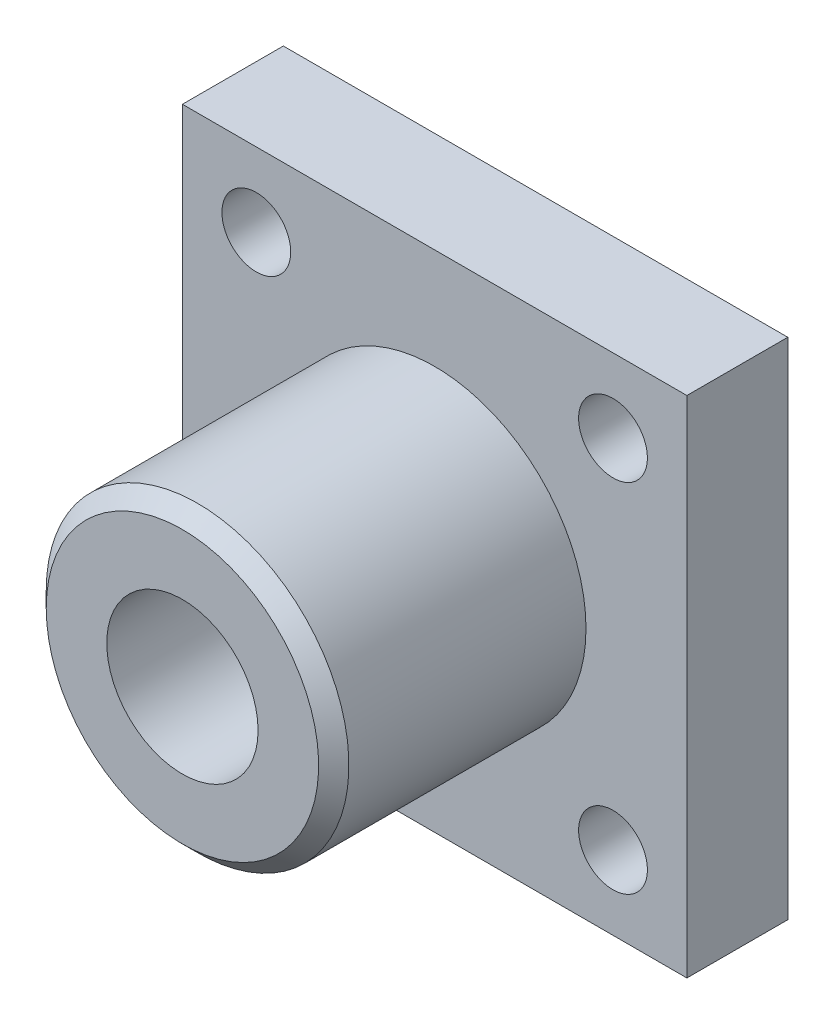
ISO-10303-21;
HEADER;
FILE_DESCRIPTION(('STEP AP214'),'2;1');
FILE_NAME('part.step','',(''),(''),'','','');
FILE_SCHEMA(('AUTOMOTIVE_DESIGN { 1 0 10303 214 1 1 1 1 }'));
ENDSEC;
DATA;
#1=APPLICATION_CONTEXT('core data for automotive mechanical design processes');
#2=APPLICATION_PROTOCOL_DEFINITION('international standard','automotive_design',2000,#1);
#3=PRODUCT_CONTEXT('',#1,'mechanical');
#4=PRODUCT('Part','Part','',(#3));
#5=PRODUCT_RELATED_PRODUCT_CATEGORY('part','',(#4));
#6=PRODUCT_DEFINITION_FORMATION('','',#4);
#7=PRODUCT_DEFINITION_CONTEXT('part definition',#1,'design');
#8=PRODUCT_DEFINITION('design','',#6,#7);
#9=PRODUCT_DEFINITION_SHAPE('','',#8);
#10=(LENGTH_UNIT() NAMED_UNIT(*) SI_UNIT(.MILLI.,.METRE.));
#11=(NAMED_UNIT(*) PLANE_ANGLE_UNIT() SI_UNIT($,.RADIAN.));
#12=(NAMED_UNIT(*) SI_UNIT($,.STERADIAN.) SOLID_ANGLE_UNIT());
#13=UNCERTAINTY_MEASURE_WITH_UNIT(LENGTH_MEASURE(1.E-05),#10,'distance_accuracy_value','');
#14=(GEOMETRIC_REPRESENTATION_CONTEXT(3) GLOBAL_UNCERTAINTY_ASSIGNED_CONTEXT((#13)) GLOBAL_UNIT_ASSIGNED_CONTEXT((#10,
#11,#12)) REPRESENTATION_CONTEXT('',''));
#15=CARTESIAN_POINT('',(0.,0.,0.));
#16=DIRECTION('',(0.,0.,1.));
#17=DIRECTION('',(1.,0.,0.));
#18=AXIS2_PLACEMENT_3D('',#15,#16,#17);
#19=CARTESIAN_POINT('',(-127.,-127.,50.8));
#20=DIRECTION('',(0.,0.,1.));
#21=DIRECTION('',(1.,0.,0.));
#22=AXIS2_PLACEMENT_3D('',#19,#20,#21);
#23=PLANE('',#22);
#24=DIRECTION('',(0.,-1.,0.));
#25=VECTOR('',#24,1.);
#26=CARTESIAN_POINT('',(-127.,127.,50.8));
#27=LINE('',#26,#25);
#28=CARTESIAN_POINT('',(-127.,127.,50.8));
#29=VERTEX_POINT('',#28);
#30=CARTESIAN_POINT('',(-127.,-127.,50.8));
#31=VERTEX_POINT('',#30);
#32=EDGE_CURVE('E96',#29,#31,#27,.T.);
#33=ORIENTED_EDGE('',*,*,#32,.T.);
#34=DIRECTION('',(1.,0.,0.));
#35=VECTOR('',#34,1.);
#36=CARTESIAN_POINT('',(-127.,-127.,50.8));
#37=LINE('',#36,#35);
#38=CARTESIAN_POINT('',(127.,-127.,50.8));
#39=VERTEX_POINT('',#38);
#40=EDGE_CURVE('E79',#31,#39,#37,.T.);
#41=ORIENTED_EDGE('',*,*,#40,.T.);
#42=DIRECTION('',(0.,1.,0.));
#43=VECTOR('',#42,1.);
#44=CARTESIAN_POINT('',(127.,127.,50.8));
#45=LINE('',#44,#43);
#46=CARTESIAN_POINT('',(127.,127.,50.8));
#47=VERTEX_POINT('',#46);
#48=EDGE_CURVE('E44',#39,#47,#45,.T.);
#49=ORIENTED_EDGE('',*,*,#48,.T.);
#50=DIRECTION('',(-1.,0.,0.));
#51=VECTOR('',#50,1.);
#52=CARTESIAN_POINT('',(-127.,127.,50.8));
#53=LINE('',#52,#51);
#54=EDGE_CURVE('E39',#47,#29,#53,.T.);
#55=ORIENTED_EDGE('',*,*,#54,.T.);
#56=EDGE_LOOP('',(#33,#41,#49,#55));
#57=FACE_BOUND('',#56,.T.);
#58=CARTESIAN_POINT('',(89.8025612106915,89.8025612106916,50.8));
#59=DIRECTION('',(0.,0.,1.));
#60=DIRECTION('',(1.,0.,0.));
#61=AXIS2_PLACEMENT_3D('',#58,#59,#60);
#62=CIRCLE('',#61,17.3240200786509);
#63=CARTESIAN_POINT('',(107.126581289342,89.8025612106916,50.8));
#64=VERTEX_POINT('',#63);
#65=EDGE_CURVE('E89',#64,#64,#62,.T.);
#66=ORIENTED_EDGE('',*,*,#65,.F.);
#67=EDGE_LOOP('',(#66));
#68=FACE_BOUND('',#67,.T.);
#69=CARTESIAN_POINT('',(-89.8025612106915,89.8025612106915,50.8));
#70=DIRECTION('',(0.,0.,1.));
#71=DIRECTION('',(1.,0.,0.));
#72=AXIS2_PLACEMENT_3D('',#69,#70,#71);
#73=CIRCLE('',#72,17.3240200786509);
#74=CARTESIAN_POINT('',(-72.4785411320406,89.8025612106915,50.8));
#75=VERTEX_POINT('',#74);
#76=EDGE_CURVE('E232',#75,#75,#73,.T.);
#77=ORIENTED_EDGE('',*,*,#76,.F.);
#78=EDGE_LOOP('',(#77));
#79=FACE_BOUND('',#78,.T.);
#80=CARTESIAN_POINT('',(-89.8025612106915,-89.8025612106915,50.8));
#81=DIRECTION('',(0.,0.,1.));
#82=DIRECTION('',(1.,0.,0.));
#83=AXIS2_PLACEMENT_3D('',#80,#81,#82);
#84=CIRCLE('',#83,17.3240200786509);
#85=CARTESIAN_POINT('',(-72.4785411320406,-89.8025612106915,50.8));
#86=VERTEX_POINT('',#85);
#87=EDGE_CURVE('E238',#86,#86,#84,.T.);
#88=ORIENTED_EDGE('',*,*,#87,.F.);
#89=EDGE_LOOP('',(#88));
#90=FACE_BOUND('',#89,.T.);
#91=CARTESIAN_POINT('',(89.8025612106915,-89.8025612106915,50.8));
#92=DIRECTION('',(0.,0.,1.));
#93=DIRECTION('',(1.,0.,0.));
#94=AXIS2_PLACEMENT_3D('',#91,#92,#93);
#95=CIRCLE('',#94,17.3240200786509);
#96=CARTESIAN_POINT('',(107.126581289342,-89.8025612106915,50.8));
#97=VERTEX_POINT('',#96);
#98=EDGE_CURVE('E242',#97,#97,#95,.T.);
#99=ORIENTED_EDGE('',*,*,#98,.F.);
#100=EDGE_LOOP('',(#99));
#101=FACE_BOUND('',#100,.T.);
#102=CARTESIAN_POINT('',(0.,0.,50.8));
#103=DIRECTION('',(0.,0.,1.));
#104=DIRECTION('',(1.,0.,0.));
#105=AXIS2_PLACEMENT_3D('',#102,#103,#104);
#106=CIRCLE('',#105,76.2);
#107=CARTESIAN_POINT('',(76.2,0.,50.8));
#108=VERTEX_POINT('',#107);
#109=EDGE_CURVE('E245',#108,#108,#106,.T.);
#110=ORIENTED_EDGE('',*,*,#109,.F.);
#111=EDGE_LOOP('',(#110));
#112=FACE_BOUND('',#111,.T.);
#113=ADVANCED_FACE('F24',(#57,#68,#79,#90,#101,#112),#23,.T.);
#114=CARTESIAN_POINT('',(-127.,127.,50.8));
#115=DIRECTION('',(1.,0.,0.));
#116=DIRECTION('',(0.,0.,-1.));
#117=AXIS2_PLACEMENT_3D('',#114,#115,#116);
#118=PLANE('',#117);
#119=DIRECTION('',(0.,-1.,0.));
#120=VECTOR('',#119,1.);
#121=CARTESIAN_POINT('',(-127.,127.,0.));
#122=LINE('',#121,#120);
#123=CARTESIAN_POINT('',(-127.,127.,0.));
#124=VERTEX_POINT('',#123);
#125=CARTESIAN_POINT('',(-127.,-127.,0.));
#126=VERTEX_POINT('',#125);
#127=EDGE_CURVE('E70',#124,#126,#122,.T.);
#128=ORIENTED_EDGE('',*,*,#127,.T.);
#129=DIRECTION('',(0.,0.,-1.));
#130=VECTOR('',#129,1.);
#131=CARTESIAN_POINT('',(-127.,-127.,50.8));
#132=LINE('',#131,#130);
#133=EDGE_CURVE('E77',#31,#126,#132,.T.);
#134=ORIENTED_EDGE('',*,*,#133,.F.);
#135=ORIENTED_EDGE('',*,*,#32,.F.);
#136=DIRECTION('',(0.,0.,-1.));
#137=VECTOR('',#136,1.);
#138=CARTESIAN_POINT('',(-127.,127.,50.8));
#139=LINE('',#138,#137);
#140=EDGE_CURVE('E85',#29,#124,#139,.T.);
#141=ORIENTED_EDGE('',*,*,#140,.T.);
#142=EDGE_LOOP('',(#128,#134,#135,#141));
#143=FACE_BOUND('',#142,.T.);
#144=ADVANCED_FACE('F26',(#143),#118,.F.);
#145=CARTESIAN_POINT('',(-127.,-127.,50.8));
#146=DIRECTION('',(0.,1.,0.));
#147=DIRECTION('',(0.,0.,1.));
#148=AXIS2_PLACEMENT_3D('',#145,#146,#147);
#149=PLANE('',#148);
#150=DIRECTION('',(1.,0.,0.));
#151=VECTOR('',#150,1.);
#152=CARTESIAN_POINT('',(-127.,-127.,0.));
#153=LINE('',#152,#151);
#154=CARTESIAN_POINT('',(127.,-127.,0.));
#155=VERTEX_POINT('',#154);
#156=EDGE_CURVE('E65',#126,#155,#153,.T.);
#157=ORIENTED_EDGE('',*,*,#156,.T.);
#158=DIRECTION('',(0.,0.,-1.));
#159=VECTOR('',#158,1.);
#160=CARTESIAN_POINT('',(127.,-127.,50.8));
#161=LINE('',#160,#159);
#162=EDGE_CURVE('E82',#39,#155,#161,.T.);
#163=ORIENTED_EDGE('',*,*,#162,.F.);
#164=ORIENTED_EDGE('',*,*,#40,.F.);
#165=ORIENTED_EDGE('',*,*,#133,.T.);
#166=EDGE_LOOP('',(#157,#163,#164,#165));
#167=FACE_BOUND('',#166,.T.);
#168=ADVANCED_FACE('F78',(#167),#149,.F.);
#169=CARTESIAN_POINT('',(127.,127.,50.8));
#170=DIRECTION('',(-1.,0.,0.));
#171=DIRECTION('',(0.,-1.,0.));
#172=AXIS2_PLACEMENT_3D('',#169,#170,#171);
#173=PLANE('',#172);
#174=DIRECTION('',(0.,1.,0.));
#175=VECTOR('',#174,1.);
#176=CARTESIAN_POINT('',(127.,127.,0.));
#177=LINE('',#176,#175);
#178=CARTESIAN_POINT('',(127.,127.,0.));
#179=VERTEX_POINT('',#178);
#180=EDGE_CURVE('E71',#155,#179,#177,.T.);
#181=ORIENTED_EDGE('',*,*,#180,.T.);
#182=DIRECTION('',(0.,0.,-1.));
#183=VECTOR('',#182,1.);
#184=CARTESIAN_POINT('',(127.,127.,50.8));
#185=LINE('',#184,#183);
#186=EDGE_CURVE('E102',#47,#179,#185,.T.);
#187=ORIENTED_EDGE('',*,*,#186,.F.);
#188=ORIENTED_EDGE('',*,*,#48,.F.);
#189=ORIENTED_EDGE('',*,*,#162,.T.);
#190=EDGE_LOOP('',(#181,#187,#188,#189));
#191=FACE_BOUND('',#190,.T.);
#192=ADVANCED_FACE('F140',(#191),#173,.F.);
#193=CARTESIAN_POINT('',(-127.,127.,50.8));
#194=DIRECTION('',(0.,-1.,0.));
#195=DIRECTION('',(0.,0.,-1.));
#196=AXIS2_PLACEMENT_3D('',#193,#194,#195);
#197=PLANE('',#196);
#198=DIRECTION('',(-1.,0.,0.));
#199=VECTOR('',#198,1.);
#200=CARTESIAN_POINT('',(-127.,127.,0.));
#201=LINE('',#200,#199);
#202=EDGE_CURVE('E94',#179,#124,#201,.T.);
#203=ORIENTED_EDGE('',*,*,#202,.T.);
#204=ORIENTED_EDGE('',*,*,#140,.F.);
#205=ORIENTED_EDGE('',*,*,#54,.F.);
#206=ORIENTED_EDGE('',*,*,#186,.T.);
#207=EDGE_LOOP('',(#203,#204,#205,#206));
#208=FACE_BOUND('',#207,.T.);
#209=ADVANCED_FACE('F137',(#208),#197,.F.);
#210=CARTESIAN_POINT('',(-127.,-127.,0.));
#211=DIRECTION('',(0.,0.,1.));
#212=DIRECTION('',(1.,0.,0.));
#213=AXIS2_PLACEMENT_3D('',#210,#211,#212);
#214=PLANE('',#213);
#215=CARTESIAN_POINT('',(0.,0.,0.));
#216=DIRECTION('',(0.,0.,1.));
#217=DIRECTION('',(1.,0.,0.));
#218=AXIS2_PLACEMENT_3D('',#215,#216,#217);
#219=CIRCLE('',#218,38.1);
#220=CARTESIAN_POINT('',(38.1,0.,0.));
#221=VERTEX_POINT('',#220);
#222=EDGE_CURVE('E215',#221,#221,#219,.T.);
#223=ORIENTED_EDGE('',*,*,#222,.T.);
#224=EDGE_LOOP('',(#223));
#225=FACE_BOUND('',#224,.T.);
#226=CARTESIAN_POINT('',(89.8025612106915,-89.8025612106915,0.));
#227=DIRECTION('',(0.,0.,1.));
#228=DIRECTION('',(1.,0.,0.));
#229=AXIS2_PLACEMENT_3D('',#226,#227,#228);
#230=CIRCLE('',#229,17.3240200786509);
#231=CARTESIAN_POINT('',(107.126581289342,-89.8025612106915,0.));
#232=VERTEX_POINT('',#231);
#233=EDGE_CURVE('E219',#232,#232,#230,.T.);
#234=ORIENTED_EDGE('',*,*,#233,.T.);
#235=EDGE_LOOP('',(#234));
#236=FACE_BOUND('',#235,.T.);
#237=CARTESIAN_POINT('',(-89.8025612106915,-89.8025612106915,0.));
#238=DIRECTION('',(0.,0.,1.));
#239=DIRECTION('',(1.,0.,0.));
#240=AXIS2_PLACEMENT_3D('',#237,#238,#239);
#241=CIRCLE('',#240,17.3240200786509);
#242=CARTESIAN_POINT('',(-72.4785411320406,-89.8025612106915,0.));
#243=VERTEX_POINT('',#242);
#244=EDGE_CURVE('E223',#243,#243,#241,.T.);
#245=ORIENTED_EDGE('',*,*,#244,.T.);
#246=EDGE_LOOP('',(#245));
#247=FACE_BOUND('',#246,.T.);
#248=CARTESIAN_POINT('',(-89.8025612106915,89.8025612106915,0.));
#249=DIRECTION('',(0.,0.,1.));
#250=DIRECTION('',(1.,0.,0.));
#251=AXIS2_PLACEMENT_3D('',#248,#249,#250);
#252=CIRCLE('',#251,17.3240200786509);
#253=CARTESIAN_POINT('',(-72.4785411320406,89.8025612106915,0.));
#254=VERTEX_POINT('',#253);
#255=EDGE_CURVE('E227',#254,#254,#252,.T.);
#256=ORIENTED_EDGE('',*,*,#255,.T.);
#257=EDGE_LOOP('',(#256));
#258=FACE_BOUND('',#257,.T.);
#259=CARTESIAN_POINT('',(89.8025612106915,89.8025612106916,0.));
#260=DIRECTION('',(0.,0.,1.));
#261=DIRECTION('',(1.,0.,0.));
#262=AXIS2_PLACEMENT_3D('',#259,#260,#261);
#263=CIRCLE('',#262,17.3240200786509);
#264=CARTESIAN_POINT('',(107.126581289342,89.8025612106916,0.));
#265=VERTEX_POINT('',#264);
#266=EDGE_CURVE('E86',#265,#265,#263,.T.);
#267=ORIENTED_EDGE('',*,*,#266,.T.);
#268=EDGE_LOOP('',(#267));
#269=FACE_BOUND('',#268,.T.);
#270=ORIENTED_EDGE('',*,*,#127,.F.);
#271=ORIENTED_EDGE('',*,*,#202,.F.);
#272=ORIENTED_EDGE('',*,*,#180,.F.);
#273=ORIENTED_EDGE('',*,*,#156,.F.);
#274=EDGE_LOOP('',(#270,#271,#272,#273));
#275=FACE_BOUND('',#274,.T.);
#276=ADVANCED_FACE('F67',(#225,#236,#247,#258,#269,#275),#214,.F.);
#277=CARTESIAN_POINT('',(89.8025612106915,89.8025612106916,0.));
#278=DIRECTION('',(0.,0.,1.));
#279=DIRECTION('',(1.,0.,0.));
#280=AXIS2_PLACEMENT_3D('',#277,#278,#279);
#281=CYLINDRICAL_SURFACE('',#280,17.3240200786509);
#282=CARTESIAN_POINT('',(107.126581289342,89.8025612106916,0.));
#283=CARTESIAN_POINT('',(107.126581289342,89.8025612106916,0.529166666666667));
#284=CARTESIAN_POINT('',(107.126581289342,89.8025612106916,1.05833333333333));
#285=CARTESIAN_POINT('',(107.126581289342,89.8025612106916,2.11666666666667));
#286=CARTESIAN_POINT('',(107.126581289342,89.8025612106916,2.64583333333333));
#287=CARTESIAN_POINT('',(107.126581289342,89.8025612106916,3.70416666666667));
#288=CARTESIAN_POINT('',(107.126581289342,89.8025612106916,4.23333333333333));
#289=CARTESIAN_POINT('',(107.126581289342,89.8025612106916,5.29166666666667));
#290=CARTESIAN_POINT('',(107.126581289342,89.8025612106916,5.82083333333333));
#291=CARTESIAN_POINT('',(107.126581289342,89.8025612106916,6.87916666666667));
#292=CARTESIAN_POINT('',(107.126581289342,89.8025612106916,7.40833333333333));
#293=CARTESIAN_POINT('',(107.126581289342,89.8025612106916,8.46666666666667));
#294=CARTESIAN_POINT('',(107.126581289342,89.8025612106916,8.99583333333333));
#295=CARTESIAN_POINT('',(107.126581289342,89.8025612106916,10.0541666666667));
#296=CARTESIAN_POINT('',(107.126581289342,89.8025612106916,10.5833333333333));
#297=CARTESIAN_POINT('',(107.126581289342,89.8025612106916,11.6416666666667));
#298=CARTESIAN_POINT('',(107.126581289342,89.8025612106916,12.1708333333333));
#299=CARTESIAN_POINT('',(107.126581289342,89.8025612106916,13.2291666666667));
#300=CARTESIAN_POINT('',(107.126581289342,89.8025612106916,13.7583333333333));
#301=CARTESIAN_POINT('',(107.126581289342,89.8025612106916,14.8166666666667));
#302=CARTESIAN_POINT('',(107.126581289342,89.8025612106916,15.3458333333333));
#303=CARTESIAN_POINT('',(107.126581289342,89.8025612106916,16.4041666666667));
#304=CARTESIAN_POINT('',(107.126581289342,89.8025612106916,16.9333333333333));
#305=CARTESIAN_POINT('',(107.126581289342,89.8025612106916,17.9916666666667));
#306=CARTESIAN_POINT('',(107.126581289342,89.8025612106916,18.5208333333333));
#307=CARTESIAN_POINT('',(107.126581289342,89.8025612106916,19.5791666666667));
#308=CARTESIAN_POINT('',(107.126581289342,89.8025612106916,20.1083333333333));
#309=CARTESIAN_POINT('',(107.126581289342,89.8025612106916,21.1666666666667));
#310=CARTESIAN_POINT('',(107.126581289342,89.8025612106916,21.6958333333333));
#311=CARTESIAN_POINT('',(107.126581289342,89.8025612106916,22.7541666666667));
#312=CARTESIAN_POINT('',(107.126581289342,89.8025612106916,23.2833333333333));
#313=CARTESIAN_POINT('',(107.126581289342,89.8025612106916,24.3416666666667));
#314=CARTESIAN_POINT('',(107.126581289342,89.8025612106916,24.8708333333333));
#315=CARTESIAN_POINT('',(107.126581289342,89.8025612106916,25.9291666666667));
#316=CARTESIAN_POINT('',(107.126581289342,89.8025612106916,26.4583333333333));
#317=CARTESIAN_POINT('',(107.126581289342,89.8025612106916,27.5166666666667));
#318=CARTESIAN_POINT('',(107.126581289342,89.8025612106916,28.0458333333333));
#319=CARTESIAN_POINT('',(107.126581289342,89.8025612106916,29.1041666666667));
#320=CARTESIAN_POINT('',(107.126581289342,89.8025612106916,29.6333333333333));
#321=CARTESIAN_POINT('',(107.126581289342,89.8025612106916,30.6916666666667));
#322=CARTESIAN_POINT('',(107.126581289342,89.8025612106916,31.2208333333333));
#323=CARTESIAN_POINT('',(107.126581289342,89.8025612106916,32.2791666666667));
#324=CARTESIAN_POINT('',(107.126581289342,89.8025612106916,32.8083333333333));
#325=CARTESIAN_POINT('',(107.126581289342,89.8025612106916,33.8666666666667));
#326=CARTESIAN_POINT('',(107.126581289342,89.8025612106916,34.3958333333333));
#327=CARTESIAN_POINT('',(107.126581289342,89.8025612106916,35.4541666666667));
#328=CARTESIAN_POINT('',(107.126581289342,89.8025612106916,35.9833333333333));
#329=CARTESIAN_POINT('',(107.126581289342,89.8025612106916,37.0416666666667));
#330=CARTESIAN_POINT('',(107.126581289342,89.8025612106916,37.5708333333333));
#331=CARTESIAN_POINT('',(107.126581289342,89.8025612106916,38.6291666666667));
#332=CARTESIAN_POINT('',(107.126581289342,89.8025612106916,39.1583333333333));
#333=CARTESIAN_POINT('',(107.126581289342,89.8025612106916,40.2166666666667));
#334=CARTESIAN_POINT('',(107.126581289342,89.8025612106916,40.7458333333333));
#335=CARTESIAN_POINT('',(107.126581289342,89.8025612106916,41.8041666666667));
#336=CARTESIAN_POINT('',(107.126581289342,89.8025612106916,42.3333333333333));
#337=CARTESIAN_POINT('',(107.126581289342,89.8025612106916,43.3916666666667));
#338=CARTESIAN_POINT('',(107.126581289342,89.8025612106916,43.9208333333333));
#339=CARTESIAN_POINT('',(107.126581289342,89.8025612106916,44.9791666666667));
#340=CARTESIAN_POINT('',(107.126581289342,89.8025612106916,45.5083333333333));
#341=CARTESIAN_POINT('',(107.126581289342,89.8025612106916,46.5666666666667));
#342=CARTESIAN_POINT('',(107.126581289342,89.8025612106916,47.0958333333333));
#343=CARTESIAN_POINT('',(107.126581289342,89.8025612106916,48.1541666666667));
#344=CARTESIAN_POINT('',(107.126581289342,89.8025612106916,48.6833333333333));
#345=CARTESIAN_POINT('',(107.126581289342,89.8025612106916,49.7416666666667));
#346=CARTESIAN_POINT('',(107.126581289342,89.8025612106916,50.2708333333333));
#347=CARTESIAN_POINT('',(107.126581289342,89.8025612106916,50.8));
#348=B_SPLINE_CURVE_WITH_KNOTS('',3,(#282,#283,#284,#285,#286,#287,#288,#289,#290,#291,#292,
#293,#294,#295,#296,#297,#298,#299,#300,#301,#302,#303,#304,#305,#306,#307,#308,#309,#310,#311,
#312,#313,#314,#315,#316,#317,#318,#319,#320,#321,#322,#323,#324,#325,#326,#327,#328,#329,#330,
#331,#332,#333,#334,#335,#336,#337,#338,#339,#340,#341,#342,#343,#344,#345,#346,#347),
.UNSPECIFIED.,.F.,.F.,(4,2,2,2,2,2,2,2,2,2,2,2,2,2,2,2,2,2,2,2,2,2,2,2,2,2,2,2,2,2,2,2,4),(0.,
1.5875,3.175,4.7625,6.35,7.9375,9.525,11.1125,12.7,14.2875,15.875,17.4625,19.05,20.6375,22.225,
23.8125,25.4,26.9875,28.575,30.1625,31.75,33.3375,34.925,36.5125,38.1,39.6875,41.275,42.8625,
44.45,46.0375,47.625,49.2125,50.8),.UNSPECIFIED.);
#349=EDGE_CURVE('BSEAM161',#265,#64,#348,.T.);
#350=ORIENTED_EDGE('',*,*,#266,.F.);
#351=ORIENTED_EDGE('',*,*,#65,.T.);
#352=ORIENTED_EDGE('',*,*,#349,.T.);
#353=ORIENTED_EDGE('',*,*,#349,.F.);
#354=EDGE_LOOP('',(#350,#352,#351,#353));
#355=FACE_BOUND('',#354,.T.);
#356=ADVANCED_FACE('F161',(#355),#281,.F.);
#357=CARTESIAN_POINT('',(-89.8025612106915,89.8025612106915,0.));
#358=DIRECTION('',(0.,0.,1.));
#359=DIRECTION('',(1.,0.,0.));
#360=AXIS2_PLACEMENT_3D('',#357,#358,#359);
#361=CYLINDRICAL_SURFACE('',#360,17.3240200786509);
#362=CARTESIAN_POINT('',(-72.4785411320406,89.8025612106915,0.));
#363=CARTESIAN_POINT('',(-72.4785411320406,89.8025612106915,0.529166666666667));
#364=CARTESIAN_POINT('',(-72.4785411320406,89.8025612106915,1.05833333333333));
#365=CARTESIAN_POINT('',(-72.4785411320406,89.8025612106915,2.11666666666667));
#366=CARTESIAN_POINT('',(-72.4785411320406,89.8025612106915,2.64583333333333));
#367=CARTESIAN_POINT('',(-72.4785411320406,89.8025612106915,3.70416666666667));
#368=CARTESIAN_POINT('',(-72.4785411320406,89.8025612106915,4.23333333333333));
#369=CARTESIAN_POINT('',(-72.4785411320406,89.8025612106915,5.29166666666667));
#370=CARTESIAN_POINT('',(-72.4785411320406,89.8025612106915,5.82083333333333));
#371=CARTESIAN_POINT('',(-72.4785411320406,89.8025612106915,6.87916666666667));
#372=CARTESIAN_POINT('',(-72.4785411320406,89.8025612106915,7.40833333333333));
#373=CARTESIAN_POINT('',(-72.4785411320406,89.8025612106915,8.46666666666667));
#374=CARTESIAN_POINT('',(-72.4785411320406,89.8025612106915,8.99583333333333));
#375=CARTESIAN_POINT('',(-72.4785411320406,89.8025612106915,10.0541666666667));
#376=CARTESIAN_POINT('',(-72.4785411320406,89.8025612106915,10.5833333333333));
#377=CARTESIAN_POINT('',(-72.4785411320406,89.8025612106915,11.6416666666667));
#378=CARTESIAN_POINT('',(-72.4785411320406,89.8025612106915,12.1708333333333));
#379=CARTESIAN_POINT('',(-72.4785411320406,89.8025612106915,13.2291666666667));
#380=CARTESIAN_POINT('',(-72.4785411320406,89.8025612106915,13.7583333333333));
#381=CARTESIAN_POINT('',(-72.4785411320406,89.8025612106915,14.8166666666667));
#382=CARTESIAN_POINT('',(-72.4785411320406,89.8025612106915,15.3458333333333));
#383=CARTESIAN_POINT('',(-72.4785411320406,89.8025612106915,16.4041666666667));
#384=CARTESIAN_POINT('',(-72.4785411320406,89.8025612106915,16.9333333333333));
#385=CARTESIAN_POINT('',(-72.4785411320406,89.8025612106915,17.9916666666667));
#386=CARTESIAN_POINT('',(-72.4785411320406,89.8025612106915,18.5208333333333));
#387=CARTESIAN_POINT('',(-72.4785411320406,89.8025612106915,19.5791666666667));
#388=CARTESIAN_POINT('',(-72.4785411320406,89.8025612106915,20.1083333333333));
#389=CARTESIAN_POINT('',(-72.4785411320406,89.8025612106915,21.1666666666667));
#390=CARTESIAN_POINT('',(-72.4785411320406,89.8025612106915,21.6958333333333));
#391=CARTESIAN_POINT('',(-72.4785411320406,89.8025612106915,22.7541666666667));
#392=CARTESIAN_POINT('',(-72.4785411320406,89.8025612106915,23.2833333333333));
#393=CARTESIAN_POINT('',(-72.4785411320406,89.8025612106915,24.3416666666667));
#394=CARTESIAN_POINT('',(-72.4785411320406,89.8025612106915,24.8708333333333));
#395=CARTESIAN_POINT('',(-72.4785411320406,89.8025612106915,25.9291666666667));
#396=CARTESIAN_POINT('',(-72.4785411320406,89.8025612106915,26.4583333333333));
#397=CARTESIAN_POINT('',(-72.4785411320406,89.8025612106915,27.5166666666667));
#398=CARTESIAN_POINT('',(-72.4785411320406,89.8025612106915,28.0458333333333));
#399=CARTESIAN_POINT('',(-72.4785411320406,89.8025612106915,29.1041666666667));
#400=CARTESIAN_POINT('',(-72.4785411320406,89.8025612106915,29.6333333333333));
#401=CARTESIAN_POINT('',(-72.4785411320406,89.8025612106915,30.6916666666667));
#402=CARTESIAN_POINT('',(-72.4785411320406,89.8025612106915,31.2208333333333));
#403=CARTESIAN_POINT('',(-72.4785411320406,89.8025612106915,32.2791666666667));
#404=CARTESIAN_POINT('',(-72.4785411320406,89.8025612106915,32.8083333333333));
#405=CARTESIAN_POINT('',(-72.4785411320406,89.8025612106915,33.8666666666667));
#406=CARTESIAN_POINT('',(-72.4785411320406,89.8025612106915,34.3958333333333));
#407=CARTESIAN_POINT('',(-72.4785411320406,89.8025612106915,35.4541666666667));
#408=CARTESIAN_POINT('',(-72.4785411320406,89.8025612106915,35.9833333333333));
#409=CARTESIAN_POINT('',(-72.4785411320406,89.8025612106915,37.0416666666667));
#410=CARTESIAN_POINT('',(-72.4785411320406,89.8025612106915,37.5708333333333));
#411=CARTESIAN_POINT('',(-72.4785411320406,89.8025612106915,38.6291666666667));
#412=CARTESIAN_POINT('',(-72.4785411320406,89.8025612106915,39.1583333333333));
#413=CARTESIAN_POINT('',(-72.4785411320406,89.8025612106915,40.2166666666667));
#414=CARTESIAN_POINT('',(-72.4785411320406,89.8025612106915,40.7458333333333));
#415=CARTESIAN_POINT('',(-72.4785411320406,89.8025612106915,41.8041666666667));
#416=CARTESIAN_POINT('',(-72.4785411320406,89.8025612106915,42.3333333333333));
#417=CARTESIAN_POINT('',(-72.4785411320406,89.8025612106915,43.3916666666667));
#418=CARTESIAN_POINT('',(-72.4785411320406,89.8025612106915,43.9208333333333));
#419=CARTESIAN_POINT('',(-72.4785411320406,89.8025612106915,44.9791666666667));
#420=CARTESIAN_POINT('',(-72.4785411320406,89.8025612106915,45.5083333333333));
#421=CARTESIAN_POINT('',(-72.4785411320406,89.8025612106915,46.5666666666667));
#422=CARTESIAN_POINT('',(-72.4785411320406,89.8025612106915,47.0958333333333));
#423=CARTESIAN_POINT('',(-72.4785411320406,89.8025612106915,48.1541666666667));
#424=CARTESIAN_POINT('',(-72.4785411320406,89.8025612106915,48.6833333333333));
#425=CARTESIAN_POINT('',(-72.4785411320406,89.8025612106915,49.7416666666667));
#426=CARTESIAN_POINT('',(-72.4785411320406,89.8025612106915,50.2708333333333));
#427=CARTESIAN_POINT('',(-72.4785411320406,89.8025612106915,50.8));
#428=B_SPLINE_CURVE_WITH_KNOTS('',3,(#362,#363,#364,#365,#366,#367,#368,#369,#370,#371,#372,
#373,#374,#375,#376,#377,#378,#379,#380,#381,#382,#383,#384,#385,#386,#387,#388,#389,#390,#391,
#392,#393,#394,#395,#396,#397,#398,#399,#400,#401,#402,#403,#404,#405,#406,#407,#408,#409,#410,
#411,#412,#413,#414,#415,#416,#417,#418,#419,#420,#421,#422,#423,#424,#425,#426,#427),
.UNSPECIFIED.,.F.,.F.,(4,2,2,2,2,2,2,2,2,2,2,2,2,2,2,2,2,2,2,2,2,2,2,2,2,2,2,2,2,2,2,2,4),(0.,
1.5875,3.175,4.7625,6.35,7.9375,9.525,11.1125,12.7,14.2875,15.875,17.4625,19.05,20.6375,22.225,
23.8125,25.4,26.9875,28.575,30.1625,31.75,33.3375,34.925,36.5125,38.1,39.6875,41.275,42.8625,
44.45,46.0375,47.625,49.2125,50.8),.UNSPECIFIED.);
#429=EDGE_CURVE('BSEAM165',#254,#75,#428,.T.);
#430=ORIENTED_EDGE('',*,*,#255,.F.);
#431=ORIENTED_EDGE('',*,*,#76,.T.);
#432=ORIENTED_EDGE('',*,*,#429,.T.);
#433=ORIENTED_EDGE('',*,*,#429,.F.);
#434=EDGE_LOOP('',(#430,#432,#431,#433));
#435=FACE_BOUND('',#434,.T.);
#436=ADVANCED_FACE('F165',(#435),#361,.F.);
#437=CARTESIAN_POINT('',(-89.8025612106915,-89.8025612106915,0.));
#438=DIRECTION('',(0.,0.,1.));
#439=DIRECTION('',(1.,0.,0.));
#440=AXIS2_PLACEMENT_3D('',#437,#438,#439);
#441=CYLINDRICAL_SURFACE('',#440,17.3240200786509);
#442=CARTESIAN_POINT('',(-72.4785411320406,-89.8025612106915,0.));
#443=CARTESIAN_POINT('',(-72.4785411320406,-89.8025612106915,0.529166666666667));
#444=CARTESIAN_POINT('',(-72.4785411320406,-89.8025612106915,1.05833333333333));
#445=CARTESIAN_POINT('',(-72.4785411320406,-89.8025612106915,2.11666666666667));
#446=CARTESIAN_POINT('',(-72.4785411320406,-89.8025612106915,2.64583333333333));
#447=CARTESIAN_POINT('',(-72.4785411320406,-89.8025612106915,3.70416666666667));
#448=CARTESIAN_POINT('',(-72.4785411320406,-89.8025612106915,4.23333333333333));
#449=CARTESIAN_POINT('',(-72.4785411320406,-89.8025612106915,5.29166666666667));
#450=CARTESIAN_POINT('',(-72.4785411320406,-89.8025612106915,5.82083333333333));
#451=CARTESIAN_POINT('',(-72.4785411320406,-89.8025612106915,6.87916666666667));
#452=CARTESIAN_POINT('',(-72.4785411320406,-89.8025612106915,7.40833333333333));
#453=CARTESIAN_POINT('',(-72.4785411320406,-89.8025612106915,8.46666666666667));
#454=CARTESIAN_POINT('',(-72.4785411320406,-89.8025612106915,8.99583333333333));
#455=CARTESIAN_POINT('',(-72.4785411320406,-89.8025612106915,10.0541666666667));
#456=CARTESIAN_POINT('',(-72.4785411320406,-89.8025612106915,10.5833333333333));
#457=CARTESIAN_POINT('',(-72.4785411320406,-89.8025612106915,11.6416666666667));
#458=CARTESIAN_POINT('',(-72.4785411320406,-89.8025612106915,12.1708333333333));
#459=CARTESIAN_POINT('',(-72.4785411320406,-89.8025612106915,13.2291666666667));
#460=CARTESIAN_POINT('',(-72.4785411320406,-89.8025612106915,13.7583333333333));
#461=CARTESIAN_POINT('',(-72.4785411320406,-89.8025612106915,14.8166666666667));
#462=CARTESIAN_POINT('',(-72.4785411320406,-89.8025612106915,15.3458333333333));
#463=CARTESIAN_POINT('',(-72.4785411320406,-89.8025612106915,16.4041666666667));
#464=CARTESIAN_POINT('',(-72.4785411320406,-89.8025612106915,16.9333333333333));
#465=CARTESIAN_POINT('',(-72.4785411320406,-89.8025612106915,17.9916666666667));
#466=CARTESIAN_POINT('',(-72.4785411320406,-89.8025612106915,18.5208333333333));
#467=CARTESIAN_POINT('',(-72.4785411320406,-89.8025612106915,19.5791666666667));
#468=CARTESIAN_POINT('',(-72.4785411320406,-89.8025612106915,20.1083333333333));
#469=CARTESIAN_POINT('',(-72.4785411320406,-89.8025612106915,21.1666666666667));
#470=CARTESIAN_POINT('',(-72.4785411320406,-89.8025612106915,21.6958333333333));
#471=CARTESIAN_POINT('',(-72.4785411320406,-89.8025612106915,22.7541666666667));
#472=CARTESIAN_POINT('',(-72.4785411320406,-89.8025612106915,23.2833333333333));
#473=CARTESIAN_POINT('',(-72.4785411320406,-89.8025612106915,24.3416666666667));
#474=CARTESIAN_POINT('',(-72.4785411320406,-89.8025612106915,24.8708333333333));
#475=CARTESIAN_POINT('',(-72.4785411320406,-89.8025612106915,25.9291666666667));
#476=CARTESIAN_POINT('',(-72.4785411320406,-89.8025612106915,26.4583333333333));
#477=CARTESIAN_POINT('',(-72.4785411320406,-89.8025612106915,27.5166666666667));
#478=CARTESIAN_POINT('',(-72.4785411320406,-89.8025612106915,28.0458333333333));
#479=CARTESIAN_POINT('',(-72.4785411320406,-89.8025612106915,29.1041666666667));
#480=CARTESIAN_POINT('',(-72.4785411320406,-89.8025612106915,29.6333333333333));
#481=CARTESIAN_POINT('',(-72.4785411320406,-89.8025612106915,30.6916666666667));
#482=CARTESIAN_POINT('',(-72.4785411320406,-89.8025612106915,31.2208333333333));
#483=CARTESIAN_POINT('',(-72.4785411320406,-89.8025612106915,32.2791666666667));
#484=CARTESIAN_POINT('',(-72.4785411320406,-89.8025612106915,32.8083333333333));
#485=CARTESIAN_POINT('',(-72.4785411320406,-89.8025612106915,33.8666666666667));
#486=CARTESIAN_POINT('',(-72.4785411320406,-89.8025612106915,34.3958333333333));
#487=CARTESIAN_POINT('',(-72.4785411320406,-89.8025612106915,35.4541666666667));
#488=CARTESIAN_POINT('',(-72.4785411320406,-89.8025612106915,35.9833333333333));
#489=CARTESIAN_POINT('',(-72.4785411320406,-89.8025612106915,37.0416666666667));
#490=CARTESIAN_POINT('',(-72.4785411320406,-89.8025612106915,37.5708333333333));
#491=CARTESIAN_POINT('',(-72.4785411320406,-89.8025612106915,38.6291666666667));
#492=CARTESIAN_POINT('',(-72.4785411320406,-89.8025612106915,39.1583333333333));
#493=CARTESIAN_POINT('',(-72.4785411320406,-89.8025612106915,40.2166666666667));
#494=CARTESIAN_POINT('',(-72.4785411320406,-89.8025612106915,40.7458333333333));
#495=CARTESIAN_POINT('',(-72.4785411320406,-89.8025612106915,41.8041666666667));
#496=CARTESIAN_POINT('',(-72.4785411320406,-89.8025612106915,42.3333333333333));
#497=CARTESIAN_POINT('',(-72.4785411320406,-89.8025612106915,43.3916666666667));
#498=CARTESIAN_POINT('',(-72.4785411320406,-89.8025612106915,43.9208333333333));
#499=CARTESIAN_POINT('',(-72.4785411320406,-89.8025612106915,44.9791666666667));
#500=CARTESIAN_POINT('',(-72.4785411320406,-89.8025612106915,45.5083333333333));
#501=CARTESIAN_POINT('',(-72.4785411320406,-89.8025612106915,46.5666666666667));
#502=CARTESIAN_POINT('',(-72.4785411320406,-89.8025612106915,47.0958333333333));
#503=CARTESIAN_POINT('',(-72.4785411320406,-89.8025612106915,48.1541666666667));
#504=CARTESIAN_POINT('',(-72.4785411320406,-89.8025612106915,48.6833333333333));
#505=CARTESIAN_POINT('',(-72.4785411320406,-89.8025612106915,49.7416666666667));
#506=CARTESIAN_POINT('',(-72.4785411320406,-89.8025612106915,50.2708333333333));
#507=CARTESIAN_POINT('',(-72.4785411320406,-89.8025612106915,50.8));
#508=B_SPLINE_CURVE_WITH_KNOTS('',3,(#442,#443,#444,#445,#446,#447,#448,#449,#450,#451,#452,
#453,#454,#455,#456,#457,#458,#459,#460,#461,#462,#463,#464,#465,#466,#467,#468,#469,#470,#471,
#472,#473,#474,#475,#476,#477,#478,#479,#480,#481,#482,#483,#484,#485,#486,#487,#488,#489,#490,
#491,#492,#493,#494,#495,#496,#497,#498,#499,#500,#501,#502,#503,#504,#505,#506,#507),
.UNSPECIFIED.,.F.,.F.,(4,2,2,2,2,2,2,2,2,2,2,2,2,2,2,2,2,2,2,2,2,2,2,2,2,2,2,2,2,2,2,2,4),(0.,
1.5875,3.175,4.7625,6.35,7.9375,9.525,11.1125,12.7,14.2875,15.875,17.4625,19.05,20.6375,22.225,
23.8125,25.4,26.9875,28.575,30.1625,31.75,33.3375,34.925,36.5125,38.1,39.6875,41.275,42.8625,
44.45,46.0375,47.625,49.2125,50.8),.UNSPECIFIED.);
#509=EDGE_CURVE('BSEAM172',#243,#86,#508,.T.);
#510=ORIENTED_EDGE('',*,*,#244,.F.);
#511=ORIENTED_EDGE('',*,*,#87,.T.);
#512=ORIENTED_EDGE('',*,*,#509,.T.);
#513=ORIENTED_EDGE('',*,*,#509,.F.);
#514=EDGE_LOOP('',(#510,#512,#511,#513));
#515=FACE_BOUND('',#514,.T.);
#516=ADVANCED_FACE('F172',(#515),#441,.F.);
#517=CARTESIAN_POINT('',(89.8025612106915,-89.8025612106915,0.));
#518=DIRECTION('',(0.,0.,1.));
#519=DIRECTION('',(1.,0.,0.));
#520=AXIS2_PLACEMENT_3D('',#517,#518,#519);
#521=CYLINDRICAL_SURFACE('',#520,17.3240200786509);
#522=CARTESIAN_POINT('',(107.126581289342,-89.8025612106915,0.));
#523=CARTESIAN_POINT('',(107.126581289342,-89.8025612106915,0.529166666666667));
#524=CARTESIAN_POINT('',(107.126581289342,-89.8025612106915,1.05833333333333));
#525=CARTESIAN_POINT('',(107.126581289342,-89.8025612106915,2.11666666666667));
#526=CARTESIAN_POINT('',(107.126581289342,-89.8025612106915,2.64583333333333));
#527=CARTESIAN_POINT('',(107.126581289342,-89.8025612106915,3.70416666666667));
#528=CARTESIAN_POINT('',(107.126581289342,-89.8025612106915,4.23333333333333));
#529=CARTESIAN_POINT('',(107.126581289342,-89.8025612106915,5.29166666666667));
#530=CARTESIAN_POINT('',(107.126581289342,-89.8025612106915,5.82083333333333));
#531=CARTESIAN_POINT('',(107.126581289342,-89.8025612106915,6.87916666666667));
#532=CARTESIAN_POINT('',(107.126581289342,-89.8025612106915,7.40833333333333));
#533=CARTESIAN_POINT('',(107.126581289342,-89.8025612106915,8.46666666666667));
#534=CARTESIAN_POINT('',(107.126581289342,-89.8025612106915,8.99583333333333));
#535=CARTESIAN_POINT('',(107.126581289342,-89.8025612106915,10.0541666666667));
#536=CARTESIAN_POINT('',(107.126581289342,-89.8025612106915,10.5833333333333));
#537=CARTESIAN_POINT('',(107.126581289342,-89.8025612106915,11.6416666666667));
#538=CARTESIAN_POINT('',(107.126581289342,-89.8025612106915,12.1708333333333));
#539=CARTESIAN_POINT('',(107.126581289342,-89.8025612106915,13.2291666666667));
#540=CARTESIAN_POINT('',(107.126581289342,-89.8025612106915,13.7583333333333));
#541=CARTESIAN_POINT('',(107.126581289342,-89.8025612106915,14.8166666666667));
#542=CARTESIAN_POINT('',(107.126581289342,-89.8025612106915,15.3458333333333));
#543=CARTESIAN_POINT('',(107.126581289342,-89.8025612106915,16.4041666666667));
#544=CARTESIAN_POINT('',(107.126581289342,-89.8025612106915,16.9333333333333));
#545=CARTESIAN_POINT('',(107.126581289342,-89.8025612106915,17.9916666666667));
#546=CARTESIAN_POINT('',(107.126581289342,-89.8025612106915,18.5208333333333));
#547=CARTESIAN_POINT('',(107.126581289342,-89.8025612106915,19.5791666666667));
#548=CARTESIAN_POINT('',(107.126581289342,-89.8025612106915,20.1083333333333));
#549=CARTESIAN_POINT('',(107.126581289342,-89.8025612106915,21.1666666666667));
#550=CARTESIAN_POINT('',(107.126581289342,-89.8025612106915,21.6958333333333));
#551=CARTESIAN_POINT('',(107.126581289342,-89.8025612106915,22.7541666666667));
#552=CARTESIAN_POINT('',(107.126581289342,-89.8025612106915,23.2833333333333));
#553=CARTESIAN_POINT('',(107.126581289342,-89.8025612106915,24.3416666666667));
#554=CARTESIAN_POINT('',(107.126581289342,-89.8025612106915,24.8708333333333));
#555=CARTESIAN_POINT('',(107.126581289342,-89.8025612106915,25.9291666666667));
#556=CARTESIAN_POINT('',(107.126581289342,-89.8025612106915,26.4583333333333));
#557=CARTESIAN_POINT('',(107.126581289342,-89.8025612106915,27.5166666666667));
#558=CARTESIAN_POINT('',(107.126581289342,-89.8025612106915,28.0458333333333));
#559=CARTESIAN_POINT('',(107.126581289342,-89.8025612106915,29.1041666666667));
#560=CARTESIAN_POINT('',(107.126581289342,-89.8025612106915,29.6333333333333));
#561=CARTESIAN_POINT('',(107.126581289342,-89.8025612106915,30.6916666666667));
#562=CARTESIAN_POINT('',(107.126581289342,-89.8025612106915,31.2208333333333));
#563=CARTESIAN_POINT('',(107.126581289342,-89.8025612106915,32.2791666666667));
#564=CARTESIAN_POINT('',(107.126581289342,-89.8025612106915,32.8083333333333));
#565=CARTESIAN_POINT('',(107.126581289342,-89.8025612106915,33.8666666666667));
#566=CARTESIAN_POINT('',(107.126581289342,-89.8025612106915,34.3958333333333));
#567=CARTESIAN_POINT('',(107.126581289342,-89.8025612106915,35.4541666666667));
#568=CARTESIAN_POINT('',(107.126581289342,-89.8025612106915,35.9833333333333));
#569=CARTESIAN_POINT('',(107.126581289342,-89.8025612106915,37.0416666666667));
#570=CARTESIAN_POINT('',(107.126581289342,-89.8025612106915,37.5708333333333));
#571=CARTESIAN_POINT('',(107.126581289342,-89.8025612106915,38.6291666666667));
#572=CARTESIAN_POINT('',(107.126581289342,-89.8025612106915,39.1583333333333));
#573=CARTESIAN_POINT('',(107.126581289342,-89.8025612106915,40.2166666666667));
#574=CARTESIAN_POINT('',(107.126581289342,-89.8025612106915,40.7458333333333));
#575=CARTESIAN_POINT('',(107.126581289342,-89.8025612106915,41.8041666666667));
#576=CARTESIAN_POINT('',(107.126581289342,-89.8025612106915,42.3333333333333));
#577=CARTESIAN_POINT('',(107.126581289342,-89.8025612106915,43.3916666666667));
#578=CARTESIAN_POINT('',(107.126581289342,-89.8025612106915,43.9208333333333));
#579=CARTESIAN_POINT('',(107.126581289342,-89.8025612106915,44.9791666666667));
#580=CARTESIAN_POINT('',(107.126581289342,-89.8025612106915,45.5083333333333));
#581=CARTESIAN_POINT('',(107.126581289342,-89.8025612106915,46.5666666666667));
#582=CARTESIAN_POINT('',(107.126581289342,-89.8025612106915,47.0958333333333));
#583=CARTESIAN_POINT('',(107.126581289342,-89.8025612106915,48.1541666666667));
#584=CARTESIAN_POINT('',(107.126581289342,-89.8025612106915,48.6833333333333));
#585=CARTESIAN_POINT('',(107.126581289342,-89.8025612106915,49.7416666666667));
#586=CARTESIAN_POINT('',(107.126581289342,-89.8025612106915,50.2708333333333));
#587=CARTESIAN_POINT('',(107.126581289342,-89.8025612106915,50.8));
#588=B_SPLINE_CURVE_WITH_KNOTS('',3,(#522,#523,#524,#525,#526,#527,#528,#529,#530,#531,#532,
#533,#534,#535,#536,#537,#538,#539,#540,#541,#542,#543,#544,#545,#546,#547,#548,#549,#550,#551,
#552,#553,#554,#555,#556,#557,#558,#559,#560,#561,#562,#563,#564,#565,#566,#567,#568,#569,#570,
#571,#572,#573,#574,#575,#576,#577,#578,#579,#580,#581,#582,#583,#584,#585,#586,#587),
.UNSPECIFIED.,.F.,.F.,(4,2,2,2,2,2,2,2,2,2,2,2,2,2,2,2,2,2,2,2,2,2,2,2,2,2,2,2,2,2,2,2,4),(0.,
1.5875,3.175,4.7625,6.35,7.9375,9.525,11.1125,12.7,14.2875,15.875,17.4625,19.05,20.6375,22.225,
23.8125,25.4,26.9875,28.575,30.1625,31.75,33.3375,34.925,36.5125,38.1,39.6875,41.275,42.8625,
44.45,46.0375,47.625,49.2125,50.8),.UNSPECIFIED.);
#589=EDGE_CURVE('BSEAM179',#232,#97,#588,.T.);
#590=ORIENTED_EDGE('',*,*,#233,.F.);
#591=ORIENTED_EDGE('',*,*,#98,.T.);
#592=ORIENTED_EDGE('',*,*,#589,.T.);
#593=ORIENTED_EDGE('',*,*,#589,.F.);
#594=EDGE_LOOP('',(#590,#592,#591,#593));
#595=FACE_BOUND('',#594,.T.);
#596=ADVANCED_FACE('F179',(#595),#521,.F.);
#597=CARTESIAN_POINT('',(0.,0.,177.8));
#598=DIRECTION('',(0.,0.,-1.));
#599=DIRECTION('',(-1.,0.,0.));
#600=AXIS2_PLACEMENT_3D('',#597,#598,#599);
#601=CYLINDRICAL_SURFACE('',#600,76.2);
#602=CARTESIAN_POINT('',(0.,0.,170.18));
#603=DIRECTION('',(0.,0.,1.));
#604=DIRECTION('',(1.,0.,0.));
#605=AXIS2_PLACEMENT_3D('',#602,#603,#604);
#606=CIRCLE('',#605,76.2);
#607=CARTESIAN_POINT('',(-76.2,0.,170.18));
#608=VERTEX_POINT('',#607);
#609=EDGE_CURVE('E11',#608,#608,#606,.F.);
#610=ORIENTED_EDGE('',*,*,#609,.T.);
#611=EDGE_LOOP('',(#610));
#612=FACE_BOUND('',#611,.T.);
#613=ORIENTED_EDGE('',*,*,#109,.T.);
#614=EDGE_LOOP('',(#613));
#615=FACE_BOUND('',#614,.T.);
#616=ADVANCED_FACE('F123',(#612,#615),#601,.T.);
#617=CARTESIAN_POINT('',(0.,0.,177.8));
#618=DIRECTION('',(0.,0.,1.));
#619=DIRECTION('',(1.,0.,0.));
#620=AXIS2_PLACEMENT_3D('',#617,#618,#619);
#621=PLANE('',#620);
#622=CARTESIAN_POINT('',(0.,0.,177.8));
#623=DIRECTION('',(0.,0.,1.));
#624=DIRECTION('',(1.,0.,0.));
#625=AXIS2_PLACEMENT_3D('',#622,#623,#624);
#626=CIRCLE('',#625,38.1);
#627=CARTESIAN_POINT('',(38.1,0.,177.8));
#628=VERTEX_POINT('',#627);
#629=EDGE_CURVE('E249',#628,#628,#626,.T.);
#630=ORIENTED_EDGE('',*,*,#629,.F.);
#631=EDGE_LOOP('',(#630));
#632=FACE_BOUND('',#631,.T.);
#633=CARTESIAN_POINT('',(0.,0.,177.8));
#634=DIRECTION('',(0.,0.,1.));
#635=DIRECTION('',(1.,0.,0.));
#636=AXIS2_PLACEMENT_3D('',#633,#634,#635);
#637=CIRCLE('',#636,68.58);
#638=CARTESIAN_POINT('',(-68.58,0.,177.8));
#639=VERTEX_POINT('',#638);
#640=EDGE_CURVE('E32',#639,#639,#637,.T.);
#641=ORIENTED_EDGE('',*,*,#640,.T.);
#642=EDGE_LOOP('',(#641));
#643=FACE_BOUND('',#642,.T.);
#644=ADVANCED_FACE('F108',(#632,#643),#621,.T.);
#645=CARTESIAN_POINT('',(0.,0.,177.8));
#646=DIRECTION('',(0.,0.,-1.));
#647=DIRECTION('',(-1.,0.,0.));
#648=AXIS2_PLACEMENT_3D('',#645,#646,#647);
#649=CONICAL_SURFACE('',#648,68.58,0.785398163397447);
#650=CARTESIAN_POINT('',(-76.2,0.,170.18));
#651=CARTESIAN_POINT('',(-76.120625,0.,170.259375));
#652=CARTESIAN_POINT('',(-76.04125,0.,170.33875));
#653=CARTESIAN_POINT('',(-75.8825,0.,170.4975));
#654=CARTESIAN_POINT('',(-75.803125,0.,170.576875));
#655=CARTESIAN_POINT('',(-75.644375,0.,170.735625));
#656=CARTESIAN_POINT('',(-75.565,0.,170.815));
#657=CARTESIAN_POINT('',(-75.40625,0.,170.97375));
#658=CARTESIAN_POINT('',(-75.326875,0.,171.053125));
#659=CARTESIAN_POINT('',(-75.168125,0.,171.211875));
#660=CARTESIAN_POINT('',(-75.08875,0.,171.29125));
#661=CARTESIAN_POINT('',(-74.93,0.,171.45));
#662=CARTESIAN_POINT('',(-74.850625,0.,171.529375));
#663=CARTESIAN_POINT('',(-74.691875,0.,171.688125));
#664=CARTESIAN_POINT('',(-74.6125,0.,171.7675));
#665=CARTESIAN_POINT('',(-74.45375,0.,171.92625));
#666=CARTESIAN_POINT('',(-74.374375,0.,172.005625));
#667=CARTESIAN_POINT('',(-74.215625,0.,172.164375));
#668=CARTESIAN_POINT('',(-74.13625,0.,172.24375));
#669=CARTESIAN_POINT('',(-73.9775,0.,172.4025));
#670=CARTESIAN_POINT('',(-73.898125,0.,172.481875));
#671=CARTESIAN_POINT('',(-73.739375,0.,172.640625));
#672=CARTESIAN_POINT('',(-73.66,0.,172.72));
#673=CARTESIAN_POINT('',(-73.50125,0.,172.87875));
#674=CARTESIAN_POINT('',(-73.421875,0.,172.958125));
#675=CARTESIAN_POINT('',(-73.263125,0.,173.116875));
#676=CARTESIAN_POINT('',(-73.18375,0.,173.19625));
#677=CARTESIAN_POINT('',(-73.025,0.,173.355));
#678=CARTESIAN_POINT('',(-72.945625,0.,173.434375));
#679=CARTESIAN_POINT('',(-72.786875,0.,173.593125));
#680=CARTESIAN_POINT('',(-72.7075,0.,173.6725));
#681=CARTESIAN_POINT('',(-72.54875,0.,173.83125));
#682=CARTESIAN_POINT('',(-72.469375,0.,173.910625));
#683=CARTESIAN_POINT('',(-72.310625,0.,174.069375));
#684=CARTESIAN_POINT('',(-72.23125,0.,174.14875));
#685=CARTESIAN_POINT('',(-72.0725,0.,174.3075));
#686=CARTESIAN_POINT('',(-71.993125,0.,174.386875));
#687=CARTESIAN_POINT('',(-71.834375,0.,174.545625));
#688=CARTESIAN_POINT('',(-71.755,0.,174.625));
#689=CARTESIAN_POINT('',(-71.59625,0.,174.78375));
#690=CARTESIAN_POINT('',(-71.516875,0.,174.863125));
#691=CARTESIAN_POINT('',(-71.358125,0.,175.021875));
#692=CARTESIAN_POINT('',(-71.27875,0.,175.10125));
#693=CARTESIAN_POINT('',(-71.12,0.,175.26));
#694=CARTESIAN_POINT('',(-71.040625,0.,175.339375));
#695=CARTESIAN_POINT('',(-70.881875,0.,175.498125));
#696=CARTESIAN_POINT('',(-70.8025,0.,175.5775));
#697=CARTESIAN_POINT('',(-70.64375,0.,175.73625));
#698=CARTESIAN_POINT('',(-70.564375,0.,175.815625));
#699=CARTESIAN_POINT('',(-70.405625,0.,175.974375));
#700=CARTESIAN_POINT('',(-70.32625,0.,176.05375));
#701=CARTESIAN_POINT('',(-70.1675,0.,176.2125));
#702=CARTESIAN_POINT('',(-70.088125,0.,176.291875));
#703=CARTESIAN_POINT('',(-69.929375,0.,176.450625));
#704=CARTESIAN_POINT('',(-69.85,0.,176.53));
#705=CARTESIAN_POINT('',(-69.69125,0.,176.68875));
#706=CARTESIAN_POINT('',(-69.611875,0.,176.768125));
#707=CARTESIAN_POINT('',(-69.453125,0.,176.926875));
#708=CARTESIAN_POINT('',(-69.37375,0.,177.00625));
#709=CARTESIAN_POINT('',(-69.215,0.,177.165));
#710=CARTESIAN_POINT('',(-69.135625,0.,177.244375));
#711=CARTESIAN_POINT('',(-68.976875,0.,177.403125));
#712=CARTESIAN_POINT('',(-68.8975,0.,177.4825));
#713=CARTESIAN_POINT('',(-68.73875,0.,177.64125));
#714=CARTESIAN_POINT('',(-68.659375,0.,177.720625));
#715=CARTESIAN_POINT('',(-68.58,0.,177.8));
#716=B_SPLINE_CURVE_WITH_KNOTS('',3,(#650,#651,#652,#653,#654,#655,#656,#657,#658,#659,#660,
#661,#662,#663,#664,#665,#666,#667,#668,#669,#670,#671,#672,#673,#674,#675,#676,#677,#678,#679,
#680,#681,#682,#683,#684,#685,#686,#687,#688,#689,#690,#691,#692,#693,#694,#695,#696,#697,#698,
#699,#700,#701,#702,#703,#704,#705,#706,#707,#708,#709,#710,#711,#712,#713,#714,#715),
.UNSPECIFIED.,.F.,.F.,(4,2,2,2,2,2,2,2,2,2,2,2,2,2,2,2,2,2,2,2,2,2,2,2,2,2,2,2,2,2,2,2,4),(0.,
0.336759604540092,0.673519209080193,1.01027881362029,1.34703841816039,1.68379802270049,
2.02055762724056,2.35731723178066,2.69407683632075,3.03083644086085,3.36759604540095,
3.70435564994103,4.04111525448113,4.37787485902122,4.71463446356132,5.05139406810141,
5.38815367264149,5.72491327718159,6.06167288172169,6.39843248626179,6.73519209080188,
7.07195169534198,7.40871129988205,7.74547090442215,8.08223050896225,8.41899011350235,
8.75574971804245,9.09250932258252,9.42926892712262,9.76602853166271,10.1027881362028,
10.4395477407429,10.776307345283),.UNSPECIFIED.);
#717=EDGE_CURVE('BSEAM110',#608,#639,#716,.T.);
#718=ORIENTED_EDGE('',*,*,#609,.F.);
#719=ORIENTED_EDGE('',*,*,#640,.F.);
#720=ORIENTED_EDGE('',*,*,#717,.T.);
#721=ORIENTED_EDGE('',*,*,#717,.F.);
#722=EDGE_LOOP('',(#718,#720,#719,#721));
#723=FACE_BOUND('',#722,.T.);
#724=ADVANCED_FACE('F110',(#723),#649,.T.);
#725=CARTESIAN_POINT('',(0.,0.,0.));
#726=DIRECTION('',(0.,0.,1.));
#727=DIRECTION('',(1.,0.,0.));
#728=AXIS2_PLACEMENT_3D('',#725,#726,#727);
#729=CYLINDRICAL_SURFACE('',#728,38.1);
#730=ORIENTED_EDGE('',*,*,#222,.F.);
#731=EDGE_LOOP('',(#730));
#732=FACE_BOUND('',#731,.T.);
#733=ORIENTED_EDGE('',*,*,#629,.T.);
#734=EDGE_LOOP('',(#733));
#735=FACE_BOUND('',#734,.T.);
#736=ADVANCED_FACE('F112',(#732,#735),#729,.F.);
#737=CLOSED_SHELL('',(#113,#144,#168,#192,#209,#276,#356,#436,#516,#596,#616,#644,#724,#736));
#738=MANIFOLD_SOLID_BREP('B2',#737);
#739=ADVANCED_BREP_SHAPE_REPRESENTATION('',(#18,#738),#14);
#740=SHAPE_DEFINITION_REPRESENTATION(#9,#739);
ENDSEC;
END-ISO-10303-21;
